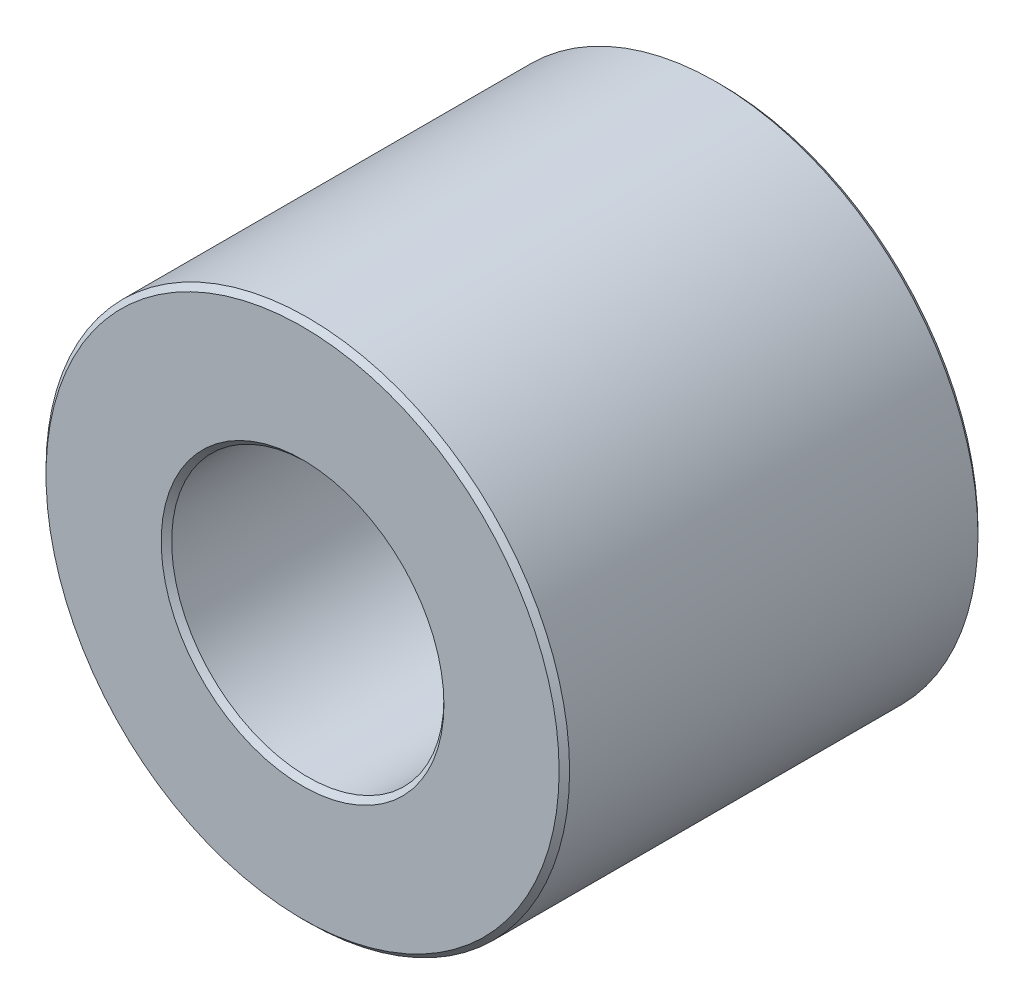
ISO-10303-21;
HEADER;
FILE_DESCRIPTION(('STEP AP214'),'2;1');
FILE_NAME('part.step','',(''),(''),'','','');
FILE_SCHEMA(('AUTOMOTIVE_DESIGN { 1 0 10303 214 1 1 1 1 }'));
ENDSEC;
DATA;
#1=APPLICATION_CONTEXT('core data for automotive mechanical design processes');
#2=APPLICATION_PROTOCOL_DEFINITION('international standard','automotive_design',2000,#1);
#3=PRODUCT_CONTEXT('',#1,'mechanical');
#4=PRODUCT('Part','Part','',(#3));
#5=PRODUCT_RELATED_PRODUCT_CATEGORY('part','',(#4));
#6=PRODUCT_DEFINITION_FORMATION('','',#4);
#7=PRODUCT_DEFINITION_CONTEXT('part definition',#1,'design');
#8=PRODUCT_DEFINITION('design','',#6,#7);
#9=PRODUCT_DEFINITION_SHAPE('','',#8);
#10=(LENGTH_UNIT() NAMED_UNIT(*) SI_UNIT(.MILLI.,.METRE.));
#11=(NAMED_UNIT(*) PLANE_ANGLE_UNIT() SI_UNIT($,.RADIAN.));
#12=(NAMED_UNIT(*) SI_UNIT($,.STERADIAN.) SOLID_ANGLE_UNIT());
#13=UNCERTAINTY_MEASURE_WITH_UNIT(LENGTH_MEASURE(1.E-05),#10,'distance_accuracy_value','');
#14=(GEOMETRIC_REPRESENTATION_CONTEXT(3) GLOBAL_UNCERTAINTY_ASSIGNED_CONTEXT((#13)) GLOBAL_UNIT_ASSIGNED_CONTEXT((#10,
#11,#12)) REPRESENTATION_CONTEXT('',''));
#15=CARTESIAN_POINT('',(0.,0.,0.));
#16=DIRECTION('',(0.,0.,1.));
#17=DIRECTION('',(1.,0.,0.));
#18=AXIS2_PLACEMENT_3D('',#15,#16,#17);
#19=CARTESIAN_POINT('',(0.,0.,4.));
#20=DIRECTION('',(0.,0.,1.));
#21=DIRECTION('',(1.,0.,0.));
#22=AXIS2_PLACEMENT_3D('',#19,#20,#21);
#23=PLANE('',#22);
#24=CARTESIAN_POINT('',(0.,0.,4.));
#25=DIRECTION('',(0.,0.,1.));
#26=DIRECTION('',(1.,0.,0.));
#27=AXIS2_PLACEMENT_3D('',#24,#25,#26);
#28=CIRCLE('',#27,2.7);
#29=CARTESIAN_POINT('',(2.7,0.,4.));
#30=VERTEX_POINT('',#29);
#31=EDGE_CURVE('E10',#30,#30,#28,.F.);
#32=ORIENTED_EDGE('',*,*,#31,.T.);
#33=EDGE_LOOP('',(#32));
#34=FACE_BOUND('',#33,.T.);
#35=CARTESIAN_POINT('',(0.,0.,4.));
#36=DIRECTION('',(0.,0.,1.));
#37=DIRECTION('',(1.,0.,0.));
#38=AXIS2_PLACEMENT_3D('',#35,#36,#37);
#39=CIRCLE('',#38,4.9);
#40=CARTESIAN_POINT('',(4.9,0.,4.));
#41=VERTEX_POINT('',#40);
#42=EDGE_CURVE('E45',#41,#41,#39,.T.);
#43=ORIENTED_EDGE('',*,*,#42,.T.);
#44=EDGE_LOOP('',(#43));
#45=FACE_BOUND('',#44,.T.);
#46=ADVANCED_FACE('F37',(#34,#45),#23,.T.);
#47=CARTESIAN_POINT('',(0.,0.,-4.));
#48=DIRECTION('',(0.,0.,1.));
#49=DIRECTION('',(1.,0.,0.));
#50=AXIS2_PLACEMENT_3D('',#47,#48,#49);
#51=PLANE('',#50);
#52=CARTESIAN_POINT('',(0.,0.,-4.));
#53=DIRECTION('',(0.,0.,1.));
#54=DIRECTION('',(1.,0.,0.));
#55=AXIS2_PLACEMENT_3D('',#52,#53,#54);
#56=CIRCLE('',#55,4.9);
#57=CARTESIAN_POINT('',(4.9,0.,-4.));
#58=VERTEX_POINT('',#57);
#59=EDGE_CURVE('E63',#58,#58,#56,.F.);
#60=ORIENTED_EDGE('',*,*,#59,.T.);
#61=EDGE_LOOP('',(#60));
#62=FACE_BOUND('',#61,.T.);
#63=CARTESIAN_POINT('',(0.,0.,-4.));
#64=DIRECTION('',(0.,0.,1.));
#65=DIRECTION('',(1.,0.,0.));
#66=AXIS2_PLACEMENT_3D('',#63,#64,#65);
#67=CIRCLE('',#66,2.7);
#68=CARTESIAN_POINT('',(2.7,0.,-4.));
#69=VERTEX_POINT('',#68);
#70=EDGE_CURVE('E67',#69,#69,#67,.T.);
#71=ORIENTED_EDGE('',*,*,#70,.T.);
#72=EDGE_LOOP('',(#71));
#73=FACE_BOUND('',#72,.T.);
#74=ADVANCED_FACE('F89',(#62,#73),#51,.F.);
#75=CARTESIAN_POINT('',(0.,0.,4.));
#76=DIRECTION('',(0.,0.,-1.));
#77=DIRECTION('',(-1.,0.,0.));
#78=AXIS2_PLACEMENT_3D('',#75,#76,#77);
#79=CYLINDRICAL_SURFACE('',#78,5.);
#80=CARTESIAN_POINT('',(0.,0.,-3.9));
#81=DIRECTION('',(0.,0.,1.));
#82=DIRECTION('',(1.,0.,0.));
#83=AXIS2_PLACEMENT_3D('',#80,#81,#82);
#84=CIRCLE('',#83,5.);
#85=CARTESIAN_POINT('',(5.,0.,-3.9));
#86=VERTEX_POINT('',#85);
#87=EDGE_CURVE('E70',#86,#86,#84,.T.);
#88=ORIENTED_EDGE('',*,*,#87,.T.);
#89=EDGE_LOOP('',(#88));
#90=FACE_BOUND('',#89,.T.);
#91=CARTESIAN_POINT('',(0.,0.,3.9));
#92=DIRECTION('',(0.,0.,1.));
#93=DIRECTION('',(1.,0.,0.));
#94=AXIS2_PLACEMENT_3D('',#91,#92,#93);
#95=CIRCLE('',#94,5.);
#96=CARTESIAN_POINT('',(5.,0.,3.9));
#97=VERTEX_POINT('',#96);
#98=EDGE_CURVE('E73',#97,#97,#95,.F.);
#99=ORIENTED_EDGE('',*,*,#98,.T.);
#100=EDGE_LOOP('',(#99));
#101=FACE_BOUND('',#100,.T.);
#102=ADVANCED_FACE('F78',(#90,#101),#79,.T.);
#103=CARTESIAN_POINT('',(0.,0.,4.));
#104=DIRECTION('',(0.,0.,-1.));
#105=DIRECTION('',(-1.,0.,0.));
#106=AXIS2_PLACEMENT_3D('',#103,#104,#105);
#107=CYLINDRICAL_SURFACE('',#106,2.6);
#108=CARTESIAN_POINT('',(0.,0.,-3.9));
#109=DIRECTION('',(0.,0.,1.));
#110=DIRECTION('',(1.,0.,0.));
#111=AXIS2_PLACEMENT_3D('',#108,#109,#110);
#112=CIRCLE('',#111,2.6);
#113=CARTESIAN_POINT('',(2.6,0.,-3.9));
#114=VERTEX_POINT('',#113);
#115=EDGE_CURVE('E52',#114,#114,#112,.F.);
#116=ORIENTED_EDGE('',*,*,#115,.T.);
#117=EDGE_LOOP('',(#116));
#118=FACE_BOUND('',#117,.T.);
#119=CARTESIAN_POINT('',(0.,0.,3.9));
#120=DIRECTION('',(0.,0.,1.));
#121=DIRECTION('',(1.,0.,0.));
#122=AXIS2_PLACEMENT_3D('',#119,#120,#121);
#123=CIRCLE('',#122,2.6);
#124=CARTESIAN_POINT('',(2.6,0.,3.9));
#125=VERTEX_POINT('',#124);
#126=EDGE_CURVE('E58',#125,#125,#123,.T.);
#127=ORIENTED_EDGE('',*,*,#126,.T.);
#128=EDGE_LOOP('',(#127));
#129=FACE_BOUND('',#128,.T.);
#130=ADVANCED_FACE('F97',(#118,#129),#107,.F.);
#131=CARTESIAN_POINT('',(0.,0.,-3.9));
#132=DIRECTION('',(0.,0.,1.));
#133=DIRECTION('',(1.,0.,0.));
#134=AXIS2_PLACEMENT_3D('',#131,#132,#133);
#135=CONICAL_SURFACE('',#134,5.,0.785398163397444);
#136=ORIENTED_EDGE('',*,*,#59,.F.);
#137=EDGE_LOOP('',(#136));
#138=FACE_BOUND('',#137,.T.);
#139=ORIENTED_EDGE('',*,*,#87,.F.);
#140=EDGE_LOOP('',(#139));
#141=FACE_BOUND('',#140,.T.);
#142=ADVANCED_FACE('F102',(#138,#141),#135,.T.);
#143=CARTESIAN_POINT('',(0.,0.,-4.));
#144=DIRECTION('',(0.,0.,-1.));
#145=DIRECTION('',(-1.,0.,0.));
#146=AXIS2_PLACEMENT_3D('',#143,#144,#145);
#147=CONICAL_SURFACE('',#146,2.7,0.785398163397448);
#148=ORIENTED_EDGE('',*,*,#115,.F.);
#149=EDGE_LOOP('',(#148));
#150=FACE_BOUND('',#149,.T.);
#151=ORIENTED_EDGE('',*,*,#70,.F.);
#152=EDGE_LOOP('',(#151));
#153=FACE_BOUND('',#152,.T.);
#154=ADVANCED_FACE('F86',(#150,#153),#147,.F.);
#155=CARTESIAN_POINT('',(0.,0.,3.9));
#156=DIRECTION('',(0.,0.,1.));
#157=DIRECTION('',(1.,0.,0.));
#158=AXIS2_PLACEMENT_3D('',#155,#156,#157);
#159=CONICAL_SURFACE('',#158,2.6,0.785398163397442);
#160=CARTESIAN_POINT('',(2.7,0.,4.));
#161=CARTESIAN_POINT('',(2.69895833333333,0.,3.99895833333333));
#162=CARTESIAN_POINT('',(2.69791666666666,0.,3.99791666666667));
#163=CARTESIAN_POINT('',(2.69583333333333,0.,3.99583333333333));
#164=CARTESIAN_POINT('',(2.69479166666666,0.,3.99479166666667));
#165=CARTESIAN_POINT('',(2.69270833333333,0.,3.99270833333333));
#166=CARTESIAN_POINT('',(2.69166666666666,0.,3.99166666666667));
#167=CARTESIAN_POINT('',(2.68958333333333,0.,3.98958333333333));
#168=CARTESIAN_POINT('',(2.68854166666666,0.,3.98854166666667));
#169=CARTESIAN_POINT('',(2.68645833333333,0.,3.98645833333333));
#170=CARTESIAN_POINT('',(2.68541666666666,0.,3.98541666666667));
#171=CARTESIAN_POINT('',(2.68333333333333,0.,3.98333333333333));
#172=CARTESIAN_POINT('',(2.68229166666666,0.,3.98229166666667));
#173=CARTESIAN_POINT('',(2.68020833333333,0.,3.98020833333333));
#174=CARTESIAN_POINT('',(2.67916666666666,0.,3.97916666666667));
#175=CARTESIAN_POINT('',(2.67708333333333,0.,3.97708333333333));
#176=CARTESIAN_POINT('',(2.67604166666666,0.,3.97604166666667));
#177=CARTESIAN_POINT('',(2.67395833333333,0.,3.97395833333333));
#178=CARTESIAN_POINT('',(2.67291666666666,0.,3.97291666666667));
#179=CARTESIAN_POINT('',(2.67083333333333,0.,3.97083333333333));
#180=CARTESIAN_POINT('',(2.66979166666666,0.,3.96979166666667));
#181=CARTESIAN_POINT('',(2.66770833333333,0.,3.96770833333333));
#182=CARTESIAN_POINT('',(2.66666666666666,0.,3.96666666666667));
#183=CARTESIAN_POINT('',(2.66458333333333,0.,3.96458333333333));
#184=CARTESIAN_POINT('',(2.66354166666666,0.,3.96354166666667));
#185=CARTESIAN_POINT('',(2.66145833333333,0.,3.96145833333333));
#186=CARTESIAN_POINT('',(2.66041666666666,0.,3.96041666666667));
#187=CARTESIAN_POINT('',(2.65833333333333,0.,3.95833333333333));
#188=CARTESIAN_POINT('',(2.65729166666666,0.,3.95729166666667));
#189=CARTESIAN_POINT('',(2.65520833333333,0.,3.95520833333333));
#190=CARTESIAN_POINT('',(2.65416666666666,0.,3.95416666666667));
#191=CARTESIAN_POINT('',(2.65208333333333,0.,3.95208333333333));
#192=CARTESIAN_POINT('',(2.65104166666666,0.,3.95104166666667));
#193=CARTESIAN_POINT('',(2.64895833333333,0.,3.94895833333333));
#194=CARTESIAN_POINT('',(2.64791666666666,0.,3.94791666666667));
#195=CARTESIAN_POINT('',(2.64583333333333,0.,3.94583333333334));
#196=CARTESIAN_POINT('',(2.64479166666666,0.,3.94479166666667));
#197=CARTESIAN_POINT('',(2.64270833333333,0.,3.94270833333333));
#198=CARTESIAN_POINT('',(2.64166666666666,0.,3.94166666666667));
#199=CARTESIAN_POINT('',(2.63958333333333,0.,3.93958333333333));
#200=CARTESIAN_POINT('',(2.63854166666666,0.,3.93854166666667));
#201=CARTESIAN_POINT('',(2.63645833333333,0.,3.93645833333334));
#202=CARTESIAN_POINT('',(2.63541666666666,0.,3.93541666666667));
#203=CARTESIAN_POINT('',(2.63333333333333,0.,3.93333333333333));
#204=CARTESIAN_POINT('',(2.63229166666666,0.,3.93229166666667));
#205=CARTESIAN_POINT('',(2.63020833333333,0.,3.93020833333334));
#206=CARTESIAN_POINT('',(2.62916666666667,0.,3.92916666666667));
#207=CARTESIAN_POINT('',(2.62708333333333,0.,3.92708333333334));
#208=CARTESIAN_POINT('',(2.62604166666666,0.,3.92604166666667));
#209=CARTESIAN_POINT('',(2.62395833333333,0.,3.92395833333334));
#210=CARTESIAN_POINT('',(2.62291666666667,0.,3.92291666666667));
#211=CARTESIAN_POINT('',(2.62083333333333,0.,3.92083333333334));
#212=CARTESIAN_POINT('',(2.61979166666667,0.,3.91979166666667));
#213=CARTESIAN_POINT('',(2.61770833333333,0.,3.91770833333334));
#214=CARTESIAN_POINT('',(2.61666666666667,0.,3.91666666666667));
#215=CARTESIAN_POINT('',(2.61458333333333,0.,3.91458333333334));
#216=CARTESIAN_POINT('',(2.61354166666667,0.,3.91354166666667));
#217=CARTESIAN_POINT('',(2.61145833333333,0.,3.91145833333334));
#218=CARTESIAN_POINT('',(2.61041666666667,0.,3.91041666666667));
#219=CARTESIAN_POINT('',(2.60833333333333,0.,3.90833333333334));
#220=CARTESIAN_POINT('',(2.60729166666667,0.,3.90729166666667));
#221=CARTESIAN_POINT('',(2.60520833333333,0.,3.90520833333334));
#222=CARTESIAN_POINT('',(2.60416666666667,0.,3.90416666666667));
#223=CARTESIAN_POINT('',(2.60208333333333,0.,3.90208333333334));
#224=CARTESIAN_POINT('',(2.60104166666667,0.,3.90104166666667));
#225=CARTESIAN_POINT('',(2.6,0.,3.9));
#226=B_SPLINE_CURVE_WITH_KNOTS('',3,(#160,#161,#162,#163,#164,#165,#166,#167,#168,#169,#170,
#171,#172,#173,#174,#175,#176,#177,#178,#179,#180,#181,#182,#183,#184,#185,#186,#187,#188,#189,
#190,#191,#192,#193,#194,#195,#196,#197,#198,#199,#200,#201,#202,#203,#204,#205,#206,#207,#208,
#209,#210,#211,#212,#213,#214,#215,#216,#217,#218,#219,#220,#221,#222,#223,#224,#225),
.UNSPECIFIED.,.F.,.F.,(4,2,2,2,2,2,2,2,2,2,2,2,2,2,2,2,2,2,2,2,2,2,2,2,2,2,2,2,2,2,2,2,4),(0.,
0.00441941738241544,0.00883883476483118,0.0132582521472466,0.017677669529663,0.0220970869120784,
0.0265165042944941,0.0309359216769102,0.0353553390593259,0.0397747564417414,0.0441941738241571,
0.0486135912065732,0.0530330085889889,0.0574524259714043,0.0618718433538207,0.0662912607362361,
0.0707106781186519,0.0751300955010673,0.0795495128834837,0.0839689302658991,0.0883883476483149,
0.0928077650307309,0.0972271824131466,0.101646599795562,0.106066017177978,0.110485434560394,
0.11490485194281,0.119324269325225,0.123743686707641,0.128163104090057,0.132582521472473,
0.137001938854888,0.141421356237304),.UNSPECIFIED.);
#227=EDGE_CURVE('BSEAM82',#30,#125,#226,.T.);
#228=ORIENTED_EDGE('',*,*,#31,.F.);
#229=ORIENTED_EDGE('',*,*,#126,.F.);
#230=ORIENTED_EDGE('',*,*,#227,.T.);
#231=ORIENTED_EDGE('',*,*,#227,.F.);
#232=EDGE_LOOP('',(#228,#230,#229,#231));
#233=FACE_BOUND('',#232,.T.);
#234=ADVANCED_FACE('F82',(#233),#159,.F.);
#235=CARTESIAN_POINT('',(0.,0.,4.));
#236=DIRECTION('',(0.,0.,-1.));
#237=DIRECTION('',(-1.,0.,0.));
#238=AXIS2_PLACEMENT_3D('',#235,#236,#237);
#239=CONICAL_SURFACE('',#238,4.9,0.78539816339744);
#240=ORIENTED_EDGE('',*,*,#98,.F.);
#241=EDGE_LOOP('',(#240));
#242=FACE_BOUND('',#241,.T.);
#243=ORIENTED_EDGE('',*,*,#42,.F.);
#244=EDGE_LOOP('',(#243));
#245=FACE_BOUND('',#244,.T.);
#246=ADVANCED_FACE('F39',(#242,#245),#239,.T.);
#247=CLOSED_SHELL('',(#46,#74,#102,#130,#142,#154,#234,#246));
#248=MANIFOLD_SOLID_BREP('B2',#247);
#249=ADVANCED_BREP_SHAPE_REPRESENTATION('',(#18,#248),#14);
#250=SHAPE_DEFINITION_REPRESENTATION(#9,#249);
ENDSEC;
END-ISO-10303-21;
